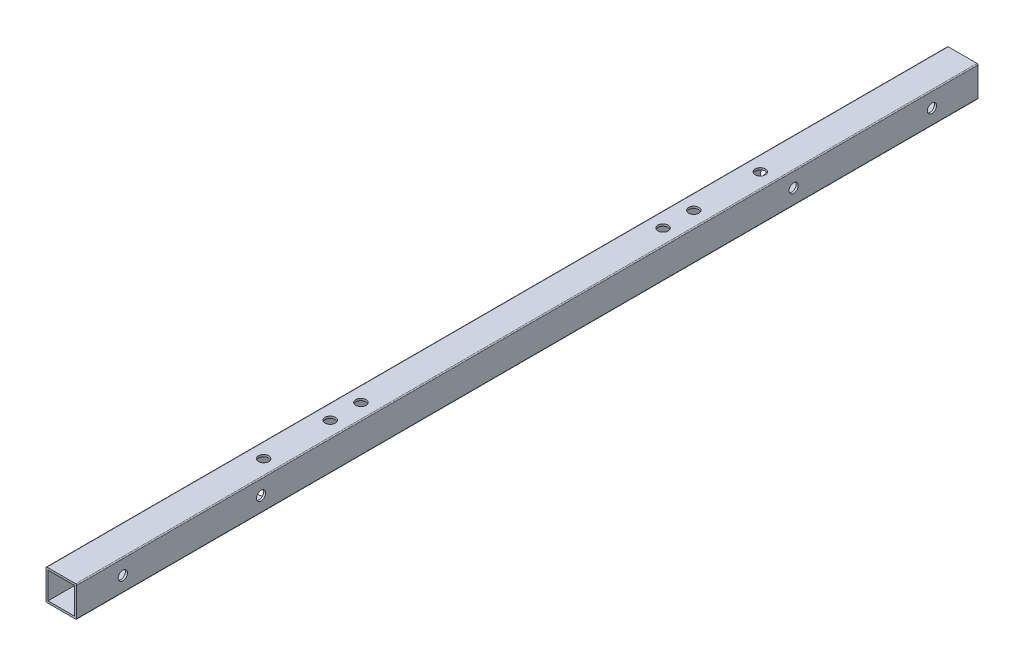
ISO-10303-21;
HEADER;
FILE_DESCRIPTION(('STEP AP214'),'2;1');
FILE_NAME('part.step','',(''),(''),'','','');
FILE_SCHEMA(('AUTOMOTIVE_DESIGN { 1 0 10303 214 1 1 1 1 }'));
ENDSEC;
DATA;
#1=APPLICATION_CONTEXT('core data for automotive mechanical design processes');
#2=APPLICATION_PROTOCOL_DEFINITION('international standard','automotive_design',2000,#1);
#3=PRODUCT_CONTEXT('',#1,'mechanical');
#4=PRODUCT('Part','Part','',(#3));
#5=PRODUCT_RELATED_PRODUCT_CATEGORY('part','',(#4));
#6=PRODUCT_DEFINITION_FORMATION('','',#4);
#7=PRODUCT_DEFINITION_CONTEXT('part definition',#1,'design');
#8=PRODUCT_DEFINITION('design','',#6,#7);
#9=PRODUCT_DEFINITION_SHAPE('','',#8);
#10=(LENGTH_UNIT() NAMED_UNIT(*) SI_UNIT(.MILLI.,.METRE.));
#11=(NAMED_UNIT(*) PLANE_ANGLE_UNIT() SI_UNIT($,.RADIAN.));
#12=(NAMED_UNIT(*) SI_UNIT($,.STERADIAN.) SOLID_ANGLE_UNIT());
#13=UNCERTAINTY_MEASURE_WITH_UNIT(LENGTH_MEASURE(1.E-05),#10,'distance_accuracy_value','');
#14=(GEOMETRIC_REPRESENTATION_CONTEXT(3) GLOBAL_UNCERTAINTY_ASSIGNED_CONTEXT((#13)) GLOBAL_UNIT_ASSIGNED_CONTEXT((#10,
#11,#12)) REPRESENTATION_CONTEXT('',''));
#15=CARTESIAN_POINT('',(0.,0.,0.));
#16=DIRECTION('',(0.,0.,1.));
#17=DIRECTION('',(1.,0.,0.));
#18=AXIS2_PLACEMENT_3D('',#15,#16,#17);
#19=CARTESIAN_POINT('',(-14.,-14.,880.));
#20=DIRECTION('',(0.,0.,-1.));
#21=DIRECTION('',(-1.,0.,0.));
#22=AXIS2_PLACEMENT_3D('',#19,#20,#21);
#23=CYLINDRICAL_SURFACE('',#22,0.999999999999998);
#24=CARTESIAN_POINT('',(-14.,-14.,0.));
#25=DIRECTION('',(0.,0.,-1.));
#26=DIRECTION('',(-1.,0.,0.));
#27=AXIS2_PLACEMENT_3D('',#24,#25,#26);
#28=CIRCLE('',#27,0.999999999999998);
#29=CARTESIAN_POINT('',(-14.,-15.,0.));
#30=VERTEX_POINT('',#29);
#31=CARTESIAN_POINT('',(-15.,-14.,0.));
#32=VERTEX_POINT('',#31);
#33=EDGE_CURVE('E126',#30,#32,#28,.T.);
#34=ORIENTED_EDGE('',*,*,#33,.F.);
#35=DIRECTION('',(0.,0.,-1.));
#36=VECTOR('',#35,1.);
#37=CARTESIAN_POINT('',(-14.,-15.,880.));
#38=LINE('',#37,#36);
#39=CARTESIAN_POINT('',(-14.,-15.,880.));
#40=VERTEX_POINT('',#39);
#41=EDGE_CURVE('E11',#40,#30,#38,.T.);
#42=ORIENTED_EDGE('',*,*,#41,.F.);
#43=CARTESIAN_POINT('',(-14.,-14.,880.));
#44=DIRECTION('',(0.,0.,-1.));
#45=DIRECTION('',(-1.,0.,0.));
#46=AXIS2_PLACEMENT_3D('',#43,#44,#45);
#47=CIRCLE('',#46,0.999999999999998);
#48=CARTESIAN_POINT('',(-15.,-14.,880.));
#49=VERTEX_POINT('',#48);
#50=EDGE_CURVE('E184',#40,#49,#47,.T.);
#51=ORIENTED_EDGE('',*,*,#50,.T.);
#52=DIRECTION('',(0.,0.,-1.));
#53=VECTOR('',#52,1.);
#54=CARTESIAN_POINT('',(-15.,-14.,880.));
#55=LINE('',#54,#53);
#56=EDGE_CURVE('E204',#49,#32,#55,.T.);
#57=ORIENTED_EDGE('',*,*,#56,.T.);
#58=EDGE_LOOP('',(#34,#42,#51,#57));
#59=FACE_BOUND('',#58,.T.);
#60=ADVANCED_FACE('F30',(#59),#23,.T.);
#61=CARTESIAN_POINT('',(14.,-15.,880.));
#62=DIRECTION('',(0.,-1.,0.));
#63=DIRECTION('',(1.,0.,0.));
#64=AXIS2_PLACEMENT_3D('',#61,#62,#63);
#65=PLANE('',#64);
#66=CARTESIAN_POINT('',(0.,-15.,682.5));
#67=DIRECTION('',(0.,-1.,0.));
#68=DIRECTION('',(1.,0.,0.));
#69=AXIS2_PLACEMENT_3D('',#66,#67,#68);
#70=CIRCLE('',#69,5.);
#71=CARTESIAN_POINT('',(5.00000000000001,-15.,682.5));
#72=VERTEX_POINT('',#71);
#73=EDGE_CURVE('E293',#72,#72,#70,.T.);
#74=ORIENTED_EDGE('',*,*,#73,.F.);
#75=EDGE_LOOP('',(#74));
#76=FACE_BOUND('',#75,.T.);
#77=CARTESIAN_POINT('',(0.,-15.,617.5));
#78=DIRECTION('',(0.,-1.,0.));
#79=DIRECTION('',(1.,0.,0.));
#80=AXIS2_PLACEMENT_3D('',#77,#78,#79);
#81=CIRCLE('',#80,5.);
#82=CARTESIAN_POINT('',(5.00000000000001,-15.,617.5));
#83=VERTEX_POINT('',#82);
#84=EDGE_CURVE('E300',#83,#83,#81,.T.);
#85=ORIENTED_EDGE('',*,*,#84,.F.);
#86=EDGE_LOOP('',(#85));
#87=FACE_BOUND('',#86,.T.);
#88=CARTESIAN_POINT('',(0.,-15.,262.5));
#89=DIRECTION('',(0.,-1.,0.));
#90=DIRECTION('',(1.,0.,0.));
#91=AXIS2_PLACEMENT_3D('',#88,#89,#90);
#92=CIRCLE('',#91,5.);
#93=CARTESIAN_POINT('',(5.00000000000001,-15.,262.5));
#94=VERTEX_POINT('',#93);
#95=EDGE_CURVE('E307',#94,#94,#92,.T.);
#96=ORIENTED_EDGE('',*,*,#95,.F.);
#97=EDGE_LOOP('',(#96));
#98=FACE_BOUND('',#97,.T.);
#99=CARTESIAN_POINT('',(0.,-15.,197.5));
#100=DIRECTION('',(0.,-1.,0.));
#101=DIRECTION('',(1.,0.,0.));
#102=AXIS2_PLACEMENT_3D('',#99,#100,#101);
#103=CIRCLE('',#102,5.);
#104=CARTESIAN_POINT('',(5.00000000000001,-15.,197.5));
#105=VERTEX_POINT('',#104);
#106=EDGE_CURVE('E314',#105,#105,#103,.T.);
#107=ORIENTED_EDGE('',*,*,#106,.F.);
#108=EDGE_LOOP('',(#107));
#109=FACE_BOUND('',#108,.T.);
#110=CARTESIAN_POINT('',(0.,-15.,587.5));
#111=DIRECTION('',(0.,-1.,0.));
#112=DIRECTION('',(1.,0.,0.));
#113=AXIS2_PLACEMENT_3D('',#110,#111,#112);
#114=CIRCLE('',#113,5.);
#115=CARTESIAN_POINT('',(5.00000000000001,-15.,587.5));
#116=VERTEX_POINT('',#115);
#117=EDGE_CURVE('E321',#116,#116,#114,.T.);
#118=ORIENTED_EDGE('',*,*,#117,.F.);
#119=EDGE_LOOP('',(#118));
#120=FACE_BOUND('',#119,.T.);
#121=CARTESIAN_POINT('',(0.,-15.,292.5));
#122=DIRECTION('',(0.,-1.,0.));
#123=DIRECTION('',(1.,0.,0.));
#124=AXIS2_PLACEMENT_3D('',#121,#122,#123);
#125=CIRCLE('',#124,5.);
#126=CARTESIAN_POINT('',(5.00000000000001,-15.,292.5));
#127=VERTEX_POINT('',#126);
#128=EDGE_CURVE('E141',#127,#127,#125,.T.);
#129=ORIENTED_EDGE('',*,*,#128,.F.);
#130=EDGE_LOOP('',(#129));
#131=FACE_BOUND('',#130,.T.);
#132=DIRECTION('',(-1.,0.,0.));
#133=VECTOR('',#132,1.);
#134=CARTESIAN_POINT('',(14.,-15.,0.));
#135=LINE('',#134,#133);
#136=CARTESIAN_POINT('',(14.,-15.,0.));
#137=VERTEX_POINT('',#136);
#138=EDGE_CURVE('E181',#137,#30,#135,.T.);
#139=ORIENTED_EDGE('',*,*,#138,.F.);
#140=DIRECTION('',(0.,0.,-1.));
#141=VECTOR('',#140,1.);
#142=CARTESIAN_POINT('',(14.,-15.,880.));
#143=LINE('',#142,#141);
#144=CARTESIAN_POINT('',(14.,-15.,880.));
#145=VERTEX_POINT('',#144);
#146=EDGE_CURVE('E38',#145,#137,#143,.T.);
#147=ORIENTED_EDGE('',*,*,#146,.F.);
#148=DIRECTION('',(-1.,0.,0.));
#149=VECTOR('',#148,1.);
#150=CARTESIAN_POINT('',(14.,-15.,880.));
#151=LINE('',#150,#149);
#152=EDGE_CURVE('E202',#145,#40,#151,.T.);
#153=ORIENTED_EDGE('',*,*,#152,.T.);
#154=ORIENTED_EDGE('',*,*,#41,.T.);
#155=EDGE_LOOP('',(#139,#147,#153,#154));
#156=FACE_BOUND('',#155,.T.);
#157=ADVANCED_FACE('F346',(#76,#87,#98,#109,#120,#131,#156),#65,.T.);
#158=CARTESIAN_POINT('',(14.,-14.,880.));
#159=DIRECTION('',(0.,0.,-1.));
#160=DIRECTION('',(-1.,0.,0.));
#161=AXIS2_PLACEMENT_3D('',#158,#159,#160);
#162=CYLINDRICAL_SURFACE('',#161,1.);
#163=CARTESIAN_POINT('',(14.,-14.,0.));
#164=DIRECTION('',(0.,0.,-1.));
#165=DIRECTION('',(-1.,0.,0.));
#166=AXIS2_PLACEMENT_3D('',#163,#164,#165);
#167=CIRCLE('',#166,1.);
#168=CARTESIAN_POINT('',(15.,-14.,0.));
#169=VERTEX_POINT('',#168);
#170=EDGE_CURVE('E178',#169,#137,#167,.T.);
#171=ORIENTED_EDGE('',*,*,#170,.F.);
#172=DIRECTION('',(0.,0.,-1.));
#173=VECTOR('',#172,1.);
#174=CARTESIAN_POINT('',(15.,-14.,880.));
#175=LINE('',#174,#173);
#176=CARTESIAN_POINT('',(15.,-14.,880.));
#177=VERTEX_POINT('',#176);
#178=EDGE_CURVE('E207',#177,#169,#175,.T.);
#179=ORIENTED_EDGE('',*,*,#178,.F.);
#180=CARTESIAN_POINT('',(14.,-14.,880.));
#181=DIRECTION('',(0.,0.,-1.));
#182=DIRECTION('',(-1.,0.,0.));
#183=AXIS2_PLACEMENT_3D('',#180,#181,#182);
#184=CIRCLE('',#183,1.);
#185=EDGE_CURVE('E199',#177,#145,#184,.T.);
#186=ORIENTED_EDGE('',*,*,#185,.T.);
#187=ORIENTED_EDGE('',*,*,#146,.T.);
#188=EDGE_LOOP('',(#171,#179,#186,#187));
#189=FACE_BOUND('',#188,.T.);
#190=ADVANCED_FACE('F351',(#189),#162,.T.);
#191=CARTESIAN_POINT('',(15.,-14.,880.));
#192=DIRECTION('',(-1.,0.,0.));
#193=DIRECTION('',(0.,-1.,0.));
#194=AXIS2_PLACEMENT_3D('',#191,#192,#193);
#195=PLANE('',#194);
#196=CARTESIAN_POINT('',(15.,0.,45.));
#197=DIRECTION('',(1.,0.,0.));
#198=DIRECTION('',(0.,1.,0.));
#199=AXIS2_PLACEMENT_3D('',#196,#197,#198);
#200=CIRCLE('',#199,4.5);
#201=CARTESIAN_POINT('',(15.,4.5,45.));
#202=VERTEX_POINT('',#201);
#203=EDGE_CURVE('E696',#202,#202,#200,.T.);
#204=ORIENTED_EDGE('',*,*,#203,.F.);
#205=EDGE_LOOP('',(#204));
#206=FACE_BOUND('',#205,.T.);
#207=CARTESIAN_POINT('',(15.,0.,180.));
#208=DIRECTION('',(1.,0.,0.));
#209=DIRECTION('',(0.,1.,0.));
#210=AXIS2_PLACEMENT_3D('',#207,#208,#209);
#211=CIRCLE('',#210,4.49999999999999);
#212=CARTESIAN_POINT('',(15.,4.49999999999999,180.));
#213=VERTEX_POINT('',#212);
#214=EDGE_CURVE('E267',#213,#213,#211,.T.);
#215=ORIENTED_EDGE('',*,*,#214,.F.);
#216=EDGE_LOOP('',(#215));
#217=FACE_BOUND('',#216,.T.);
#218=CARTESIAN_POINT('',(15.,0.,700.));
#219=DIRECTION('',(1.,0.,0.));
#220=DIRECTION('',(0.,1.,0.));
#221=AXIS2_PLACEMENT_3D('',#218,#219,#220);
#222=CIRCLE('',#221,4.49999999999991);
#223=CARTESIAN_POINT('',(15.,4.49999999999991,700.));
#224=VERTEX_POINT('',#223);
#225=EDGE_CURVE('E264',#224,#224,#222,.T.);
#226=ORIENTED_EDGE('',*,*,#225,.F.);
#227=EDGE_LOOP('',(#226));
#228=FACE_BOUND('',#227,.T.);
#229=CARTESIAN_POINT('',(15.,0.,835.));
#230=DIRECTION('',(1.,0.,0.));
#231=DIRECTION('',(0.,1.,0.));
#232=AXIS2_PLACEMENT_3D('',#229,#230,#231);
#233=CIRCLE('',#232,4.49999999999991);
#234=CARTESIAN_POINT('',(15.,4.49999999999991,835.));
#235=VERTEX_POINT('',#234);
#236=EDGE_CURVE('E282',#235,#235,#233,.T.);
#237=ORIENTED_EDGE('',*,*,#236,.F.);
#238=EDGE_LOOP('',(#237));
#239=FACE_BOUND('',#238,.T.);
#240=DIRECTION('',(0.,1.,0.));
#241=VECTOR('',#240,1.);
#242=CARTESIAN_POINT('',(15.,-14.,0.));
#243=LINE('',#242,#241);
#244=CARTESIAN_POINT('',(15.,14.,0.));
#245=VERTEX_POINT('',#244);
#246=EDGE_CURVE('E176',#169,#245,#243,.T.);
#247=ORIENTED_EDGE('',*,*,#246,.T.);
#248=DIRECTION('',(0.,0.,-1.));
#249=VECTOR('',#248,1.);
#250=CARTESIAN_POINT('',(15.,14.,880.));
#251=LINE('',#250,#249);
#252=CARTESIAN_POINT('',(15.,14.,880.));
#253=VERTEX_POINT('',#252);
#254=EDGE_CURVE('E209',#253,#245,#251,.T.);
#255=ORIENTED_EDGE('',*,*,#254,.F.);
#256=DIRECTION('',(0.,1.,0.));
#257=VECTOR('',#256,1.);
#258=CARTESIAN_POINT('',(15.,-14.,880.));
#259=LINE('',#258,#257);
#260=EDGE_CURVE('E197',#177,#253,#259,.T.);
#261=ORIENTED_EDGE('',*,*,#260,.F.);
#262=ORIENTED_EDGE('',*,*,#178,.T.);
#263=EDGE_LOOP('',(#247,#255,#261,#262));
#264=FACE_BOUND('',#263,.T.);
#265=ADVANCED_FACE('F385',(#206,#217,#228,#239,#264),#195,.F.);
#266=CARTESIAN_POINT('',(14.,14.,880.));
#267=DIRECTION('',(0.,0.,-1.));
#268=DIRECTION('',(-1.,0.,0.));
#269=AXIS2_PLACEMENT_3D('',#266,#267,#268);
#270=CYLINDRICAL_SURFACE('',#269,0.999999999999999);
#271=CARTESIAN_POINT('',(14.,14.,0.));
#272=DIRECTION('',(0.,0.,1.));
#273=DIRECTION('',(1.,0.,0.));
#274=AXIS2_PLACEMENT_3D('',#271,#272,#273);
#275=CIRCLE('',#274,0.999999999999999);
#276=CARTESIAN_POINT('',(14.,15.,0.));
#277=VERTEX_POINT('',#276);
#278=EDGE_CURVE('E173',#245,#277,#275,.T.);
#279=ORIENTED_EDGE('',*,*,#278,.T.);
#280=DIRECTION('',(0.,0.,-1.));
#281=VECTOR('',#280,1.);
#282=CARTESIAN_POINT('',(14.,15.,880.));
#283=LINE('',#282,#281);
#284=CARTESIAN_POINT('',(14.,15.,880.));
#285=VERTEX_POINT('',#284);
#286=EDGE_CURVE('E212',#285,#277,#283,.T.);
#287=ORIENTED_EDGE('',*,*,#286,.F.);
#288=CARTESIAN_POINT('',(14.,14.,880.));
#289=DIRECTION('',(0.,0.,1.));
#290=DIRECTION('',(1.,0.,0.));
#291=AXIS2_PLACEMENT_3D('',#288,#289,#290);
#292=CIRCLE('',#291,0.999999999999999);
#293=EDGE_CURVE('E195',#253,#285,#292,.T.);
#294=ORIENTED_EDGE('',*,*,#293,.F.);
#295=ORIENTED_EDGE('',*,*,#254,.T.);
#296=EDGE_LOOP('',(#279,#287,#294,#295));
#297=FACE_BOUND('',#296,.T.);
#298=ADVANCED_FACE('F380',(#297),#270,.T.);
#299=CARTESIAN_POINT('',(-14.,15.,880.));
#300=DIRECTION('',(0.,1.,0.));
#301=DIRECTION('',(0.,0.,1.));
#302=AXIS2_PLACEMENT_3D('',#299,#300,#301);
#303=PLANE('',#302);
#304=CARTESIAN_POINT('',(0.,15.,682.5));
#305=DIRECTION('',(0.,1.,0.));
#306=DIRECTION('',(0.,0.,1.));
#307=AXIS2_PLACEMENT_3D('',#304,#305,#306);
#308=CIRCLE('',#307,5.);
#309=CARTESIAN_POINT('',(0.,15.,687.5));
#310=VERTEX_POINT('',#309);
#311=EDGE_CURVE('E247',#310,#310,#308,.T.);
#312=ORIENTED_EDGE('',*,*,#311,.F.);
#313=EDGE_LOOP('',(#312));
#314=FACE_BOUND('',#313,.T.);
#315=CARTESIAN_POINT('',(0.,15.,617.5));
#316=DIRECTION('',(0.,1.,0.));
#317=DIRECTION('',(0.,0.,1.));
#318=AXIS2_PLACEMENT_3D('',#315,#316,#317);
#319=CIRCLE('',#318,5.);
#320=CARTESIAN_POINT('',(0.,15.,622.5));
#321=VERTEX_POINT('',#320);
#322=EDGE_CURVE('E242',#321,#321,#319,.T.);
#323=ORIENTED_EDGE('',*,*,#322,.F.);
#324=EDGE_LOOP('',(#323));
#325=FACE_BOUND('',#324,.T.);
#326=CARTESIAN_POINT('',(0.,15.,262.5));
#327=DIRECTION('',(0.,1.,0.));
#328=DIRECTION('',(0.,0.,1.));
#329=AXIS2_PLACEMENT_3D('',#326,#327,#328);
#330=CIRCLE('',#329,5.);
#331=CARTESIAN_POINT('',(0.,15.,267.5));
#332=VERTEX_POINT('',#331);
#333=EDGE_CURVE('E237',#332,#332,#330,.T.);
#334=ORIENTED_EDGE('',*,*,#333,.F.);
#335=EDGE_LOOP('',(#334));
#336=FACE_BOUND('',#335,.T.);
#337=CARTESIAN_POINT('',(0.,15.,197.5));
#338=DIRECTION('',(0.,1.,0.));
#339=DIRECTION('',(0.,0.,1.));
#340=AXIS2_PLACEMENT_3D('',#337,#338,#339);
#341=CIRCLE('',#340,5.);
#342=CARTESIAN_POINT('',(0.,15.,202.5));
#343=VERTEX_POINT('',#342);
#344=EDGE_CURVE('E232',#343,#343,#341,.T.);
#345=ORIENTED_EDGE('',*,*,#344,.F.);
#346=EDGE_LOOP('',(#345));
#347=FACE_BOUND('',#346,.T.);
#348=CARTESIAN_POINT('',(0.,15.,587.5));
#349=DIRECTION('',(0.,1.,0.));
#350=DIRECTION('',(0.,0.,1.));
#351=AXIS2_PLACEMENT_3D('',#348,#349,#350);
#352=CIRCLE('',#351,5.);
#353=CARTESIAN_POINT('',(0.,15.,592.5));
#354=VERTEX_POINT('',#353);
#355=EDGE_CURVE('E227',#354,#354,#352,.T.);
#356=ORIENTED_EDGE('',*,*,#355,.F.);
#357=EDGE_LOOP('',(#356));
#358=FACE_BOUND('',#357,.T.);
#359=CARTESIAN_POINT('',(0.,15.,292.5));
#360=DIRECTION('',(0.,1.,0.));
#361=DIRECTION('',(0.,0.,1.));
#362=AXIS2_PLACEMENT_3D('',#359,#360,#361);
#363=CIRCLE('',#362,5.);
#364=CARTESIAN_POINT('',(0.,15.,297.5));
#365=VERTEX_POINT('',#364);
#366=EDGE_CURVE('E222',#365,#365,#363,.T.);
#367=ORIENTED_EDGE('',*,*,#366,.F.);
#368=EDGE_LOOP('',(#367));
#369=FACE_BOUND('',#368,.T.);
#370=DIRECTION('',(1.,0.,0.));
#371=VECTOR('',#370,1.);
#372=CARTESIAN_POINT('',(-14.,15.,0.));
#373=LINE('',#372,#371);
#374=CARTESIAN_POINT('',(-14.,15.,0.));
#375=VERTEX_POINT('',#374);
#376=EDGE_CURVE('E170',#375,#277,#373,.T.);
#377=ORIENTED_EDGE('',*,*,#376,.F.);
#378=DIRECTION('',(0.,0.,-1.));
#379=VECTOR('',#378,1.);
#380=CARTESIAN_POINT('',(-14.,15.,880.));
#381=LINE('',#380,#379);
#382=CARTESIAN_POINT('',(-14.,15.,880.));
#383=VERTEX_POINT('',#382);
#384=EDGE_CURVE('E214',#383,#375,#381,.T.);
#385=ORIENTED_EDGE('',*,*,#384,.F.);
#386=DIRECTION('',(1.,0.,0.));
#387=VECTOR('',#386,1.);
#388=CARTESIAN_POINT('',(-14.,15.,880.));
#389=LINE('',#388,#387);
#390=EDGE_CURVE('E192',#383,#285,#389,.T.);
#391=ORIENTED_EDGE('',*,*,#390,.T.);
#392=ORIENTED_EDGE('',*,*,#286,.T.);
#393=EDGE_LOOP('',(#377,#385,#391,#392));
#394=FACE_BOUND('',#393,.T.);
#395=ADVANCED_FACE('F376',(#314,#325,#336,#347,#358,#369,#394),#303,.T.);
#396=CARTESIAN_POINT('',(-14.,14.,880.));
#397=DIRECTION('',(0.,0.,-1.));
#398=DIRECTION('',(-1.,0.,0.));
#399=AXIS2_PLACEMENT_3D('',#396,#397,#398);
#400=CYLINDRICAL_SURFACE('',#399,0.999999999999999);
#401=CARTESIAN_POINT('',(-14.,14.,0.));
#402=DIRECTION('',(0.,0.,-1.));
#403=DIRECTION('',(-1.,0.,0.));
#404=AXIS2_PLACEMENT_3D('',#401,#402,#403);
#405=CIRCLE('',#404,0.999999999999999);
#406=CARTESIAN_POINT('',(-15.,14.,0.));
#407=VERTEX_POINT('',#406);
#408=EDGE_CURVE('E167',#407,#375,#405,.T.);
#409=ORIENTED_EDGE('',*,*,#408,.F.);
#410=DIRECTION('',(0.,0.,-1.));
#411=VECTOR('',#410,1.);
#412=CARTESIAN_POINT('',(-15.,14.,880.));
#413=LINE('',#412,#411);
#414=CARTESIAN_POINT('',(-15.,14.,880.));
#415=VERTEX_POINT('',#414);
#416=EDGE_CURVE('E216',#415,#407,#413,.T.);
#417=ORIENTED_EDGE('',*,*,#416,.F.);
#418=CARTESIAN_POINT('',(-14.,14.,880.));
#419=DIRECTION('',(0.,0.,-1.));
#420=DIRECTION('',(-1.,0.,0.));
#421=AXIS2_PLACEMENT_3D('',#418,#419,#420);
#422=CIRCLE('',#421,0.999999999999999);
#423=EDGE_CURVE('E189',#415,#383,#422,.T.);
#424=ORIENTED_EDGE('',*,*,#423,.T.);
#425=ORIENTED_EDGE('',*,*,#384,.T.);
#426=EDGE_LOOP('',(#409,#417,#424,#425));
#427=FACE_BOUND('',#426,.T.);
#428=ADVANCED_FACE('F373',(#427),#400,.T.);
#429=CARTESIAN_POINT('',(-15.,14.,880.));
#430=DIRECTION('',(1.,0.,0.));
#431=DIRECTION('',(0.,1.,0.));
#432=AXIS2_PLACEMENT_3D('',#429,#430,#431);
#433=PLANE('',#432);
#434=CARTESIAN_POINT('',(-15.,0.,45.));
#435=DIRECTION('',(1.,0.,0.));
#436=DIRECTION('',(0.,1.,0.));
#437=AXIS2_PLACEMENT_3D('',#434,#435,#436);
#438=CIRCLE('',#437,4.5);
#439=CARTESIAN_POINT('',(-15.,4.5,45.));
#440=VERTEX_POINT('',#439);
#441=EDGE_CURVE('E410',#440,#440,#438,.T.);
#442=ORIENTED_EDGE('',*,*,#441,.T.);
#443=EDGE_LOOP('',(#442));
#444=FACE_BOUND('',#443,.T.);
#445=CARTESIAN_POINT('',(-15.,0.,180.));
#446=DIRECTION('',(1.,0.,0.));
#447=DIRECTION('',(0.,1.,0.));
#448=AXIS2_PLACEMENT_3D('',#445,#446,#447);
#449=CIRCLE('',#448,4.49999999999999);
#450=CARTESIAN_POINT('',(-15.,4.49999999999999,180.));
#451=VERTEX_POINT('',#450);
#452=EDGE_CURVE('E260',#451,#451,#449,.T.);
#453=ORIENTED_EDGE('',*,*,#452,.T.);
#454=EDGE_LOOP('',(#453));
#455=FACE_BOUND('',#454,.T.);
#456=CARTESIAN_POINT('',(-15.,0.,700.));
#457=DIRECTION('',(1.,0.,0.));
#458=DIRECTION('',(0.,1.,0.));
#459=AXIS2_PLACEMENT_3D('',#456,#457,#458);
#460=CIRCLE('',#459,4.49999999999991);
#461=CARTESIAN_POINT('',(-15.,4.49999999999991,700.));
#462=VERTEX_POINT('',#461);
#463=EDGE_CURVE('E256',#462,#462,#460,.T.);
#464=ORIENTED_EDGE('',*,*,#463,.T.);
#465=EDGE_LOOP('',(#464));
#466=FACE_BOUND('',#465,.T.);
#467=CARTESIAN_POINT('',(-15.,0.,835.));
#468=DIRECTION('',(1.,0.,0.));
#469=DIRECTION('',(0.,1.,0.));
#470=AXIS2_PLACEMENT_3D('',#467,#468,#469);
#471=CIRCLE('',#470,4.49999999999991);
#472=CARTESIAN_POINT('',(-15.,4.49999999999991,835.));
#473=VERTEX_POINT('',#472);
#474=EDGE_CURVE('E252',#473,#473,#471,.T.);
#475=ORIENTED_EDGE('',*,*,#474,.T.);
#476=EDGE_LOOP('',(#475));
#477=FACE_BOUND('',#476,.T.);
#478=DIRECTION('',(0.,-1.,0.));
#479=VECTOR('',#478,1.);
#480=CARTESIAN_POINT('',(-15.,14.,0.));
#481=LINE('',#480,#479);
#482=EDGE_CURVE('E164',#407,#32,#481,.T.);
#483=ORIENTED_EDGE('',*,*,#482,.T.);
#484=ORIENTED_EDGE('',*,*,#56,.F.);
#485=DIRECTION('',(0.,-1.,0.));
#486=VECTOR('',#485,1.);
#487=CARTESIAN_POINT('',(-15.,14.,880.));
#488=LINE('',#487,#486);
#489=EDGE_CURVE('E187',#415,#49,#488,.T.);
#490=ORIENTED_EDGE('',*,*,#489,.F.);
#491=ORIENTED_EDGE('',*,*,#416,.T.);
#492=EDGE_LOOP('',(#483,#484,#490,#491));
#493=FACE_BOUND('',#492,.T.);
#494=ADVANCED_FACE('F370',(#444,#455,#466,#477,#493),#433,.F.);
#495=CARTESIAN_POINT('',(-14.,-14.,880.));
#496=DIRECTION('',(0.,0.,-1.));
#497=DIRECTION('',(-1.,0.,0.));
#498=AXIS2_PLACEMENT_3D('',#495,#496,#497);
#499=PLANE('',#498);
#500=DIRECTION('',(0.,1.,0.));
#501=VECTOR('',#500,1.);
#502=CARTESIAN_POINT('',(13.,-14.,880.));
#503=LINE('',#502,#501);
#504=CARTESIAN_POINT('',(13.,-13.,880.));
#505=VERTEX_POINT('',#504);
#506=CARTESIAN_POINT('',(13.,13.,880.));
#507=VERTEX_POINT('',#506);
#508=EDGE_CURVE('E153',#505,#507,#503,.T.);
#509=ORIENTED_EDGE('',*,*,#508,.F.);
#510=DIRECTION('',(-1.,0.,0.));
#511=VECTOR('',#510,1.);
#512=CARTESIAN_POINT('',(-14.,-13.,880.));
#513=LINE('',#512,#511);
#514=CARTESIAN_POINT('',(-13.,-13.,880.));
#515=VERTEX_POINT('',#514);
#516=EDGE_CURVE('E151',#505,#515,#513,.T.);
#517=ORIENTED_EDGE('',*,*,#516,.T.);
#518=DIRECTION('',(0.,-1.,0.));
#519=VECTOR('',#518,1.);
#520=CARTESIAN_POINT('',(-13.,-14.,880.));
#521=LINE('',#520,#519);
#522=CARTESIAN_POINT('',(-13.,13.,880.));
#523=VERTEX_POINT('',#522);
#524=EDGE_CURVE('E122',#523,#515,#521,.T.);
#525=ORIENTED_EDGE('',*,*,#524,.F.);
#526=DIRECTION('',(1.,0.,0.));
#527=VECTOR('',#526,1.);
#528=CARTESIAN_POINT('',(-14.,13.,880.));
#529=LINE('',#528,#527);
#530=EDGE_CURVE('E155',#523,#507,#529,.T.);
#531=ORIENTED_EDGE('',*,*,#530,.T.);
#532=EDGE_LOOP('',(#509,#517,#525,#531));
#533=FACE_BOUND('',#532,.T.);
#534=ORIENTED_EDGE('',*,*,#50,.F.);
#535=ORIENTED_EDGE('',*,*,#152,.F.);
#536=ORIENTED_EDGE('',*,*,#185,.F.);
#537=ORIENTED_EDGE('',*,*,#260,.T.);
#538=ORIENTED_EDGE('',*,*,#293,.T.);
#539=ORIENTED_EDGE('',*,*,#390,.F.);
#540=ORIENTED_EDGE('',*,*,#423,.F.);
#541=ORIENTED_EDGE('',*,*,#489,.T.);
#542=EDGE_LOOP('',(#534,#535,#536,#537,#538,#539,#540,#541));
#543=FACE_BOUND('',#542,.T.);
#544=ADVANCED_FACE('F365',(#533,#543),#499,.F.);
#545=CARTESIAN_POINT('',(-14.,-14.,0.));
#546=DIRECTION('',(0.,0.,-1.));
#547=DIRECTION('',(-1.,0.,0.));
#548=AXIS2_PLACEMENT_3D('',#545,#546,#547);
#549=PLANE('',#548);
#550=DIRECTION('',(-1.,0.,0.));
#551=VECTOR('',#550,1.);
#552=CARTESIAN_POINT('',(-14.,-13.,0.));
#553=LINE('',#552,#551);
#554=CARTESIAN_POINT('',(13.,-13.,0.));
#555=VERTEX_POINT('',#554);
#556=CARTESIAN_POINT('',(-13.,-13.,0.));
#557=VERTEX_POINT('',#556);
#558=EDGE_CURVE('E130',#555,#557,#553,.T.);
#559=ORIENTED_EDGE('',*,*,#558,.F.);
#560=DIRECTION('',(0.,1.,0.));
#561=VECTOR('',#560,1.);
#562=CARTESIAN_POINT('',(13.,-14.,0.));
#563=LINE('',#562,#561);
#564=CARTESIAN_POINT('',(13.,13.,0.));
#565=VERTEX_POINT('',#564);
#566=EDGE_CURVE('E135',#555,#565,#563,.T.);
#567=ORIENTED_EDGE('',*,*,#566,.T.);
#568=DIRECTION('',(1.,0.,0.));
#569=VECTOR('',#568,1.);
#570=CARTESIAN_POINT('',(-14.,13.,0.));
#571=LINE('',#570,#569);
#572=CARTESIAN_POINT('',(-13.,13.,0.));
#573=VERTEX_POINT('',#572);
#574=EDGE_CURVE('E140',#573,#565,#571,.T.);
#575=ORIENTED_EDGE('',*,*,#574,.F.);
#576=DIRECTION('',(0.,-1.,0.));
#577=VECTOR('',#576,1.);
#578=CARTESIAN_POINT('',(-13.,-14.,0.));
#579=LINE('',#578,#577);
#580=EDGE_CURVE('E54',#573,#557,#579,.T.);
#581=ORIENTED_EDGE('',*,*,#580,.T.);
#582=EDGE_LOOP('',(#559,#567,#575,#581));
#583=FACE_BOUND('',#582,.T.);
#584=ORIENTED_EDGE('',*,*,#33,.T.);
#585=ORIENTED_EDGE('',*,*,#482,.F.);
#586=ORIENTED_EDGE('',*,*,#408,.T.);
#587=ORIENTED_EDGE('',*,*,#376,.T.);
#588=ORIENTED_EDGE('',*,*,#278,.F.);
#589=ORIENTED_EDGE('',*,*,#246,.F.);
#590=ORIENTED_EDGE('',*,*,#170,.T.);
#591=ORIENTED_EDGE('',*,*,#138,.T.);
#592=EDGE_LOOP('',(#584,#585,#586,#587,#588,#589,#590,#591));
#593=FACE_BOUND('',#592,.T.);
#594=ADVANCED_FACE('F138',(#583,#593),#549,.T.);
#595=CARTESIAN_POINT('',(-13.,-14.,880.));
#596=DIRECTION('',(1.,0.,0.));
#597=DIRECTION('',(0.,1.,0.));
#598=AXIS2_PLACEMENT_3D('',#595,#596,#597);
#599=PLANE('',#598);
#600=CARTESIAN_POINT('',(-13.,0.,45.));
#601=DIRECTION('',(1.,0.,0.));
#602=DIRECTION('',(0.,1.,0.));
#603=AXIS2_PLACEMENT_3D('',#600,#601,#602);
#604=CIRCLE('',#603,4.5);
#605=CARTESIAN_POINT('',(-13.,4.5,45.));
#606=VERTEX_POINT('',#605);
#607=EDGE_CURVE('E272',#606,#606,#604,.T.);
#608=ORIENTED_EDGE('',*,*,#607,.F.);
#609=EDGE_LOOP('',(#608));
#610=FACE_BOUND('',#609,.T.);
#611=CARTESIAN_POINT('',(-13.,0.,180.));
#612=DIRECTION('',(1.,0.,0.));
#613=DIRECTION('',(0.,1.,0.));
#614=AXIS2_PLACEMENT_3D('',#611,#612,#613);
#615=CIRCLE('',#614,4.49999999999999);
#616=CARTESIAN_POINT('',(-13.,4.49999999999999,180.));
#617=VERTEX_POINT('',#616);
#618=EDGE_CURVE('E259',#617,#617,#615,.T.);
#619=ORIENTED_EDGE('',*,*,#618,.F.);
#620=EDGE_LOOP('',(#619));
#621=FACE_BOUND('',#620,.T.);
#622=CARTESIAN_POINT('',(-13.,0.,700.));
#623=DIRECTION('',(1.,0.,0.));
#624=DIRECTION('',(0.,1.,0.));
#625=AXIS2_PLACEMENT_3D('',#622,#623,#624);
#626=CIRCLE('',#625,4.49999999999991);
#627=CARTESIAN_POINT('',(-13.,4.49999999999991,700.));
#628=VERTEX_POINT('',#627);
#629=EDGE_CURVE('E255',#628,#628,#626,.T.);
#630=ORIENTED_EDGE('',*,*,#629,.F.);
#631=EDGE_LOOP('',(#630));
#632=FACE_BOUND('',#631,.T.);
#633=CARTESIAN_POINT('',(-13.,0.,835.));
#634=DIRECTION('',(1.,0.,0.));
#635=DIRECTION('',(0.,1.,0.));
#636=AXIS2_PLACEMENT_3D('',#633,#634,#635);
#637=CIRCLE('',#636,4.49999999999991);
#638=CARTESIAN_POINT('',(-13.,4.49999999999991,835.));
#639=VERTEX_POINT('',#638);
#640=EDGE_CURVE('E251',#639,#639,#637,.T.);
#641=ORIENTED_EDGE('',*,*,#640,.F.);
#642=EDGE_LOOP('',(#641));
#643=FACE_BOUND('',#642,.T.);
#644=ORIENTED_EDGE('',*,*,#580,.F.);
#645=DIRECTION('',(0.,0.,-1.));
#646=VECTOR('',#645,1.);
#647=CARTESIAN_POINT('',(-13.,13.,880.));
#648=LINE('',#647,#646);
#649=EDGE_CURVE('E158',#523,#573,#648,.T.);
#650=ORIENTED_EDGE('',*,*,#649,.F.);
#651=ORIENTED_EDGE('',*,*,#524,.T.);
#652=DIRECTION('',(0.,0.,-1.));
#653=VECTOR('',#652,1.);
#654=CARTESIAN_POINT('',(-13.,-13.,880.));
#655=LINE('',#654,#653);
#656=EDGE_CURVE('E118',#515,#557,#655,.T.);
#657=ORIENTED_EDGE('',*,*,#656,.T.);
#658=EDGE_LOOP('',(#644,#650,#651,#657));
#659=FACE_BOUND('',#658,.T.);
#660=ADVANCED_FACE('F120',(#610,#621,#632,#643,#659),#599,.T.);
#661=CARTESIAN_POINT('',(-14.,-13.,880.));
#662=DIRECTION('',(0.,-1.,0.));
#663=DIRECTION('',(1.,0.,0.));
#664=AXIS2_PLACEMENT_3D('',#661,#662,#663);
#665=PLANE('',#664);
#666=CARTESIAN_POINT('',(0.,-13.,682.5));
#667=DIRECTION('',(0.,-1.,0.));
#668=DIRECTION('',(1.,0.,0.));
#669=AXIS2_PLACEMENT_3D('',#666,#667,#668);
#670=CIRCLE('',#669,5.);
#671=CARTESIAN_POINT('',(5.00000000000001,-13.,682.5));
#672=VERTEX_POINT('',#671);
#673=EDGE_CURVE('E246',#672,#672,#670,.T.);
#674=ORIENTED_EDGE('',*,*,#673,.T.);
#675=EDGE_LOOP('',(#674));
#676=FACE_BOUND('',#675,.T.);
#677=CARTESIAN_POINT('',(0.,-13.,617.5));
#678=DIRECTION('',(0.,-1.,0.));
#679=DIRECTION('',(1.,0.,0.));
#680=AXIS2_PLACEMENT_3D('',#677,#678,#679);
#681=CIRCLE('',#680,5.);
#682=CARTESIAN_POINT('',(5.00000000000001,-13.,617.5));
#683=VERTEX_POINT('',#682);
#684=EDGE_CURVE('E241',#683,#683,#681,.T.);
#685=ORIENTED_EDGE('',*,*,#684,.T.);
#686=EDGE_LOOP('',(#685));
#687=FACE_BOUND('',#686,.T.);
#688=CARTESIAN_POINT('',(0.,-13.,262.5));
#689=DIRECTION('',(0.,-1.,0.));
#690=DIRECTION('',(1.,0.,0.));
#691=AXIS2_PLACEMENT_3D('',#688,#689,#690);
#692=CIRCLE('',#691,5.);
#693=CARTESIAN_POINT('',(5.00000000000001,-13.,262.5));
#694=VERTEX_POINT('',#693);
#695=EDGE_CURVE('E236',#694,#694,#692,.T.);
#696=ORIENTED_EDGE('',*,*,#695,.T.);
#697=EDGE_LOOP('',(#696));
#698=FACE_BOUND('',#697,.T.);
#699=CARTESIAN_POINT('',(0.,-13.,197.5));
#700=DIRECTION('',(0.,-1.,0.));
#701=DIRECTION('',(1.,0.,0.));
#702=AXIS2_PLACEMENT_3D('',#699,#700,#701);
#703=CIRCLE('',#702,5.);
#704=CARTESIAN_POINT('',(5.00000000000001,-13.,197.5));
#705=VERTEX_POINT('',#704);
#706=EDGE_CURVE('E231',#705,#705,#703,.T.);
#707=ORIENTED_EDGE('',*,*,#706,.T.);
#708=EDGE_LOOP('',(#707));
#709=FACE_BOUND('',#708,.T.);
#710=CARTESIAN_POINT('',(0.,-13.,587.5));
#711=DIRECTION('',(0.,-1.,0.));
#712=DIRECTION('',(1.,0.,0.));
#713=AXIS2_PLACEMENT_3D('',#710,#711,#712);
#714=CIRCLE('',#713,5.);
#715=CARTESIAN_POINT('',(5.00000000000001,-13.,587.5));
#716=VERTEX_POINT('',#715);
#717=EDGE_CURVE('E223',#716,#716,#714,.T.);
#718=ORIENTED_EDGE('',*,*,#717,.T.);
#719=EDGE_LOOP('',(#718));
#720=FACE_BOUND('',#719,.T.);
#721=CARTESIAN_POINT('',(0.,-13.,292.5));
#722=DIRECTION('',(0.,-1.,0.));
#723=DIRECTION('',(1.,0.,0.));
#724=AXIS2_PLACEMENT_3D('',#721,#722,#723);
#725=CIRCLE('',#724,5.);
#726=CARTESIAN_POINT('',(5.00000000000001,-13.,292.5));
#727=VERTEX_POINT('',#726);
#728=EDGE_CURVE('E144',#727,#727,#725,.T.);
#729=ORIENTED_EDGE('',*,*,#728,.T.);
#730=EDGE_LOOP('',(#729));
#731=FACE_BOUND('',#730,.T.);
#732=ORIENTED_EDGE('',*,*,#558,.T.);
#733=ORIENTED_EDGE('',*,*,#656,.F.);
#734=ORIENTED_EDGE('',*,*,#516,.F.);
#735=DIRECTION('',(0.,0.,-1.));
#736=VECTOR('',#735,1.);
#737=CARTESIAN_POINT('',(13.,-13.,880.));
#738=LINE('',#737,#736);
#739=EDGE_CURVE('E127',#505,#555,#738,.T.);
#740=ORIENTED_EDGE('',*,*,#739,.T.);
#741=EDGE_LOOP('',(#732,#733,#734,#740));
#742=FACE_BOUND('',#741,.T.);
#743=ADVANCED_FACE('F131',(#676,#687,#698,#709,#720,#731,#742),#665,.F.);
#744=CARTESIAN_POINT('',(13.,-14.,880.));
#745=DIRECTION('',(-1.,0.,0.));
#746=DIRECTION('',(0.,-1.,0.));
#747=AXIS2_PLACEMENT_3D('',#744,#745,#746);
#748=PLANE('',#747);
#749=CARTESIAN_POINT('',(13.,0.,45.));
#750=DIRECTION('',(-1.,0.,0.));
#751=DIRECTION('',(0.,-1.,0.));
#752=AXIS2_PLACEMENT_3D('',#749,#750,#751);
#753=CIRCLE('',#752,4.5);
#754=CARTESIAN_POINT('',(13.,-4.5,45.));
#755=VERTEX_POINT('',#754);
#756=EDGE_CURVE('E33',#755,#755,#753,.T.);
#757=ORIENTED_EDGE('',*,*,#756,.F.);
#758=EDGE_LOOP('',(#757));
#759=FACE_BOUND('',#758,.T.);
#760=CARTESIAN_POINT('',(13.,0.,180.));
#761=DIRECTION('',(-1.,0.,0.));
#762=DIRECTION('',(0.,-1.,0.));
#763=AXIS2_PLACEMENT_3D('',#760,#761,#762);
#764=CIRCLE('',#763,4.49999999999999);
#765=CARTESIAN_POINT('',(13.,-4.49999999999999,180.));
#766=VERTEX_POINT('',#765);
#767=EDGE_CURVE('E257',#766,#766,#764,.T.);
#768=ORIENTED_EDGE('',*,*,#767,.F.);
#769=EDGE_LOOP('',(#768));
#770=FACE_BOUND('',#769,.T.);
#771=CARTESIAN_POINT('',(13.,0.,700.));
#772=DIRECTION('',(-1.,0.,0.));
#773=DIRECTION('',(0.,-1.,0.));
#774=AXIS2_PLACEMENT_3D('',#771,#772,#773);
#775=CIRCLE('',#774,4.49999999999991);
#776=CARTESIAN_POINT('',(13.,-4.49999999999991,700.));
#777=VERTEX_POINT('',#776);
#778=EDGE_CURVE('E253',#777,#777,#775,.T.);
#779=ORIENTED_EDGE('',*,*,#778,.F.);
#780=EDGE_LOOP('',(#779));
#781=FACE_BOUND('',#780,.T.);
#782=CARTESIAN_POINT('',(13.,0.,835.));
#783=DIRECTION('',(-1.,0.,0.));
#784=DIRECTION('',(0.,-1.,0.));
#785=AXIS2_PLACEMENT_3D('',#782,#783,#784);
#786=CIRCLE('',#785,4.49999999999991);
#787=CARTESIAN_POINT('',(13.,-4.49999999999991,835.));
#788=VERTEX_POINT('',#787);
#789=EDGE_CURVE('E248',#788,#788,#786,.T.);
#790=ORIENTED_EDGE('',*,*,#789,.F.);
#791=EDGE_LOOP('',(#790));
#792=FACE_BOUND('',#791,.T.);
#793=ORIENTED_EDGE('',*,*,#566,.F.);
#794=ORIENTED_EDGE('',*,*,#739,.F.);
#795=ORIENTED_EDGE('',*,*,#508,.T.);
#796=DIRECTION('',(0.,0.,-1.));
#797=VECTOR('',#796,1.);
#798=CARTESIAN_POINT('',(13.,13.,880.));
#799=LINE('',#798,#797);
#800=EDGE_CURVE('E46',#507,#565,#799,.T.);
#801=ORIENTED_EDGE('',*,*,#800,.T.);
#802=EDGE_LOOP('',(#793,#794,#795,#801));
#803=FACE_BOUND('',#802,.T.);
#804=ADVANCED_FACE('F463',(#759,#770,#781,#792,#803),#748,.T.);
#805=CARTESIAN_POINT('',(-14.,13.,880.));
#806=DIRECTION('',(0.,1.,0.));
#807=DIRECTION('',(0.,0.,1.));
#808=AXIS2_PLACEMENT_3D('',#805,#806,#807);
#809=PLANE('',#808);
#810=CARTESIAN_POINT('',(0.,13.,682.5));
#811=DIRECTION('',(0.,1.,0.));
#812=DIRECTION('',(0.,0.,1.));
#813=AXIS2_PLACEMENT_3D('',#810,#811,#812);
#814=CIRCLE('',#813,5.);
#815=CARTESIAN_POINT('',(0.,13.,687.5));
#816=VERTEX_POINT('',#815);
#817=EDGE_CURVE('E243',#816,#816,#814,.T.);
#818=ORIENTED_EDGE('',*,*,#817,.T.);
#819=EDGE_LOOP('',(#818));
#820=FACE_BOUND('',#819,.T.);
#821=CARTESIAN_POINT('',(0.,13.,617.5));
#822=DIRECTION('',(0.,1.,0.));
#823=DIRECTION('',(0.,0.,1.));
#824=AXIS2_PLACEMENT_3D('',#821,#822,#823);
#825=CIRCLE('',#824,5.);
#826=CARTESIAN_POINT('',(0.,13.,622.5));
#827=VERTEX_POINT('',#826);
#828=EDGE_CURVE('E238',#827,#827,#825,.T.);
#829=ORIENTED_EDGE('',*,*,#828,.T.);
#830=EDGE_LOOP('',(#829));
#831=FACE_BOUND('',#830,.T.);
#832=CARTESIAN_POINT('',(0.,13.,262.5));
#833=DIRECTION('',(0.,1.,0.));
#834=DIRECTION('',(0.,0.,1.));
#835=AXIS2_PLACEMENT_3D('',#832,#833,#834);
#836=CIRCLE('',#835,5.);
#837=CARTESIAN_POINT('',(0.,13.,267.5));
#838=VERTEX_POINT('',#837);
#839=EDGE_CURVE('E233',#838,#838,#836,.T.);
#840=ORIENTED_EDGE('',*,*,#839,.T.);
#841=EDGE_LOOP('',(#840));
#842=FACE_BOUND('',#841,.T.);
#843=CARTESIAN_POINT('',(0.,13.,197.5));
#844=DIRECTION('',(0.,1.,0.));
#845=DIRECTION('',(0.,0.,1.));
#846=AXIS2_PLACEMENT_3D('',#843,#844,#845);
#847=CIRCLE('',#846,5.);
#848=CARTESIAN_POINT('',(0.,13.,202.5));
#849=VERTEX_POINT('',#848);
#850=EDGE_CURVE('E228',#849,#849,#847,.T.);
#851=ORIENTED_EDGE('',*,*,#850,.T.);
#852=EDGE_LOOP('',(#851));
#853=FACE_BOUND('',#852,.T.);
#854=CARTESIAN_POINT('',(0.,13.,587.5));
#855=DIRECTION('',(0.,1.,0.));
#856=DIRECTION('',(0.,0.,1.));
#857=AXIS2_PLACEMENT_3D('',#854,#855,#856);
#858=CIRCLE('',#857,5.);
#859=CARTESIAN_POINT('',(0.,13.,592.5));
#860=VERTEX_POINT('',#859);
#861=EDGE_CURVE('E226',#860,#860,#858,.T.);
#862=ORIENTED_EDGE('',*,*,#861,.T.);
#863=EDGE_LOOP('',(#862));
#864=FACE_BOUND('',#863,.T.);
#865=CARTESIAN_POINT('',(0.,13.,292.5));
#866=DIRECTION('',(0.,1.,0.));
#867=DIRECTION('',(0.,0.,1.));
#868=AXIS2_PLACEMENT_3D('',#865,#866,#867);
#869=CIRCLE('',#868,5.);
#870=CARTESIAN_POINT('',(0.,13.,297.5));
#871=VERTEX_POINT('',#870);
#872=EDGE_CURVE('E219',#871,#871,#869,.T.);
#873=ORIENTED_EDGE('',*,*,#872,.T.);
#874=EDGE_LOOP('',(#873));
#875=FACE_BOUND('',#874,.T.);
#876=ORIENTED_EDGE('',*,*,#574,.T.);
#877=ORIENTED_EDGE('',*,*,#800,.F.);
#878=ORIENTED_EDGE('',*,*,#530,.F.);
#879=ORIENTED_EDGE('',*,*,#649,.T.);
#880=EDGE_LOOP('',(#876,#877,#878,#879));
#881=FACE_BOUND('',#880,.T.);
#882=ADVANCED_FACE('F342',(#820,#831,#842,#853,#864,#875,#881),#809,.F.);
#883=CARTESIAN_POINT('',(0.,-20.,292.5));
#884=DIRECTION('',(0.,1.,0.));
#885=DIRECTION('',(0.,0.,1.));
#886=AXIS2_PLACEMENT_3D('',#883,#884,#885);
#887=CYLINDRICAL_SURFACE('',#886,5.);
#888=ORIENTED_EDGE('',*,*,#366,.T.);
#889=EDGE_LOOP('',(#888));
#890=FACE_BOUND('',#889,.T.);
#891=ORIENTED_EDGE('',*,*,#872,.F.);
#892=EDGE_LOOP('',(#891));
#893=FACE_BOUND('',#892,.T.);
#894=ADVANCED_FACE('F332',(#890,#893),#887,.F.);
#895=ORIENTED_EDGE('',*,*,#128,.T.);
#896=EDGE_LOOP('',(#895));
#897=FACE_BOUND('',#896,.T.);
#898=ORIENTED_EDGE('',*,*,#728,.F.);
#899=EDGE_LOOP('',(#898));
#900=FACE_BOUND('',#899,.T.);
#901=ADVANCED_FACE('F329',(#897,#900),#887,.F.);
#902=CARTESIAN_POINT('',(0.,-20.,587.5));
#903=DIRECTION('',(0.,1.,0.));
#904=DIRECTION('',(0.,0.,1.));
#905=AXIS2_PLACEMENT_3D('',#902,#903,#904);
#906=CYLINDRICAL_SURFACE('',#905,5.);
#907=ORIENTED_EDGE('',*,*,#117,.T.);
#908=EDGE_LOOP('',(#907));
#909=FACE_BOUND('',#908,.T.);
#910=ORIENTED_EDGE('',*,*,#717,.F.);
#911=EDGE_LOOP('',(#910));
#912=FACE_BOUND('',#911,.T.);
#913=ADVANCED_FACE('F331',(#909,#912),#906,.F.);
#914=ORIENTED_EDGE('',*,*,#355,.T.);
#915=EDGE_LOOP('',(#914));
#916=FACE_BOUND('',#915,.T.);
#917=ORIENTED_EDGE('',*,*,#861,.F.);
#918=EDGE_LOOP('',(#917));
#919=FACE_BOUND('',#918,.T.);
#920=ADVANCED_FACE('F339',(#916,#919),#906,.F.);
#921=CARTESIAN_POINT('',(0.,-20.,197.5));
#922=DIRECTION('',(0.,1.,0.));
#923=DIRECTION('',(0.,0.,1.));
#924=AXIS2_PLACEMENT_3D('',#921,#922,#923);
#925=CYLINDRICAL_SURFACE('',#924,5.);
#926=ORIENTED_EDGE('',*,*,#344,.T.);
#927=EDGE_LOOP('',(#926));
#928=FACE_BOUND('',#927,.T.);
#929=ORIENTED_EDGE('',*,*,#850,.F.);
#930=EDGE_LOOP('',(#929));
#931=FACE_BOUND('',#930,.T.);
#932=ADVANCED_FACE('F449',(#928,#931),#925,.F.);
#933=ORIENTED_EDGE('',*,*,#106,.T.);
#934=EDGE_LOOP('',(#933));
#935=FACE_BOUND('',#934,.T.);
#936=ORIENTED_EDGE('',*,*,#706,.F.);
#937=EDGE_LOOP('',(#936));
#938=FACE_BOUND('',#937,.T.);
#939=ADVANCED_FACE('F447',(#935,#938),#925,.F.);
#940=CARTESIAN_POINT('',(0.,-20.,262.5));
#941=DIRECTION('',(0.,1.,0.));
#942=DIRECTION('',(0.,0.,1.));
#943=AXIS2_PLACEMENT_3D('',#940,#941,#942);
#944=CYLINDRICAL_SURFACE('',#943,5.);
#945=ORIENTED_EDGE('',*,*,#333,.T.);
#946=EDGE_LOOP('',(#945));
#947=FACE_BOUND('',#946,.T.);
#948=ORIENTED_EDGE('',*,*,#839,.F.);
#949=EDGE_LOOP('',(#948));
#950=FACE_BOUND('',#949,.T.);
#951=ADVANCED_FACE('F445',(#947,#950),#944,.F.);
#952=ORIENTED_EDGE('',*,*,#95,.T.);
#953=EDGE_LOOP('',(#952));
#954=FACE_BOUND('',#953,.T.);
#955=ORIENTED_EDGE('',*,*,#695,.F.);
#956=EDGE_LOOP('',(#955));
#957=FACE_BOUND('',#956,.T.);
#958=ADVANCED_FACE('F442',(#954,#957),#944,.F.);
#959=CARTESIAN_POINT('',(0.,-20.,617.5));
#960=DIRECTION('',(0.,1.,0.));
#961=DIRECTION('',(0.,0.,1.));
#962=AXIS2_PLACEMENT_3D('',#959,#960,#961);
#963=CYLINDRICAL_SURFACE('',#962,5.);
#964=ORIENTED_EDGE('',*,*,#322,.T.);
#965=EDGE_LOOP('',(#964));
#966=FACE_BOUND('',#965,.T.);
#967=ORIENTED_EDGE('',*,*,#828,.F.);
#968=EDGE_LOOP('',(#967));
#969=FACE_BOUND('',#968,.T.);
#970=ADVANCED_FACE('F440',(#966,#969),#963,.F.);
#971=ORIENTED_EDGE('',*,*,#84,.T.);
#972=EDGE_LOOP('',(#971));
#973=FACE_BOUND('',#972,.T.);
#974=ORIENTED_EDGE('',*,*,#684,.F.);
#975=EDGE_LOOP('',(#974));
#976=FACE_BOUND('',#975,.T.);
#977=ADVANCED_FACE('F437',(#973,#976),#963,.F.);
#978=CARTESIAN_POINT('',(0.,-20.,682.5));
#979=DIRECTION('',(0.,1.,0.));
#980=DIRECTION('',(0.,0.,1.));
#981=AXIS2_PLACEMENT_3D('',#978,#979,#980);
#982=CYLINDRICAL_SURFACE('',#981,5.);
#983=ORIENTED_EDGE('',*,*,#311,.T.);
#984=EDGE_LOOP('',(#983));
#985=FACE_BOUND('',#984,.T.);
#986=ORIENTED_EDGE('',*,*,#817,.F.);
#987=EDGE_LOOP('',(#986));
#988=FACE_BOUND('',#987,.T.);
#989=ADVANCED_FACE('F435',(#985,#988),#982,.F.);
#990=ORIENTED_EDGE('',*,*,#73,.T.);
#991=EDGE_LOOP('',(#990));
#992=FACE_BOUND('',#991,.T.);
#993=ORIENTED_EDGE('',*,*,#673,.F.);
#994=EDGE_LOOP('',(#993));
#995=FACE_BOUND('',#994,.T.);
#996=ADVANCED_FACE('F429',(#992,#995),#982,.F.);
#997=CARTESIAN_POINT('',(-15.,0.,835.));
#998=DIRECTION('',(1.,0.,0.));
#999=DIRECTION('',(0.,1.,0.));
#1000=AXIS2_PLACEMENT_3D('',#997,#998,#999);
#1001=CYLINDRICAL_SURFACE('',#1000,4.49999999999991);
#1002=ORIENTED_EDGE('',*,*,#789,.T.);
#1003=EDGE_LOOP('',(#1002));
#1004=FACE_BOUND('',#1003,.T.);
#1005=ORIENTED_EDGE('',*,*,#236,.T.);
#1006=EDGE_LOOP('',(#1005));
#1007=FACE_BOUND('',#1006,.T.);
#1008=ADVANCED_FACE('F419',(#1004,#1007),#1001,.F.);
#1009=ORIENTED_EDGE('',*,*,#640,.T.);
#1010=EDGE_LOOP('',(#1009));
#1011=FACE_BOUND('',#1010,.T.);
#1012=ORIENTED_EDGE('',*,*,#474,.F.);
#1013=EDGE_LOOP('',(#1012));
#1014=FACE_BOUND('',#1013,.T.);
#1015=ADVANCED_FACE('F416',(#1011,#1014),#1001,.F.);
#1016=CARTESIAN_POINT('',(-15.,0.,700.));
#1017=DIRECTION('',(1.,0.,0.));
#1018=DIRECTION('',(0.,1.,0.));
#1019=AXIS2_PLACEMENT_3D('',#1016,#1017,#1018);
#1020=CYLINDRICAL_SURFACE('',#1019,4.49999999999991);
#1021=ORIENTED_EDGE('',*,*,#778,.T.);
#1022=EDGE_LOOP('',(#1021));
#1023=FACE_BOUND('',#1022,.T.);
#1024=ORIENTED_EDGE('',*,*,#225,.T.);
#1025=EDGE_LOOP('',(#1024));
#1026=FACE_BOUND('',#1025,.T.);
#1027=ADVANCED_FACE('F418',(#1023,#1026),#1020,.F.);
#1028=ORIENTED_EDGE('',*,*,#629,.T.);
#1029=EDGE_LOOP('',(#1028));
#1030=FACE_BOUND('',#1029,.T.);
#1031=ORIENTED_EDGE('',*,*,#463,.F.);
#1032=EDGE_LOOP('',(#1031));
#1033=FACE_BOUND('',#1032,.T.);
#1034=ADVANCED_FACE('F426',(#1030,#1033),#1020,.F.);
#1035=CARTESIAN_POINT('',(-15.,0.,180.));
#1036=DIRECTION('',(1.,0.,0.));
#1037=DIRECTION('',(0.,1.,0.));
#1038=AXIS2_PLACEMENT_3D('',#1035,#1036,#1037);
#1039=CYLINDRICAL_SURFACE('',#1038,4.49999999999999);
#1040=ORIENTED_EDGE('',*,*,#767,.T.);
#1041=EDGE_LOOP('',(#1040));
#1042=FACE_BOUND('',#1041,.T.);
#1043=ORIENTED_EDGE('',*,*,#214,.T.);
#1044=EDGE_LOOP('',(#1043));
#1045=FACE_BOUND('',#1044,.T.);
#1046=ADVANCED_FACE('F654',(#1042,#1045),#1039,.F.);
#1047=ORIENTED_EDGE('',*,*,#618,.T.);
#1048=EDGE_LOOP('',(#1047));
#1049=FACE_BOUND('',#1048,.T.);
#1050=ORIENTED_EDGE('',*,*,#452,.F.);
#1051=EDGE_LOOP('',(#1050));
#1052=FACE_BOUND('',#1051,.T.);
#1053=ADVANCED_FACE('F663',(#1049,#1052),#1039,.F.);
#1054=CARTESIAN_POINT('',(-15.,0.,45.));
#1055=DIRECTION('',(1.,0.,0.));
#1056=DIRECTION('',(0.,1.,0.));
#1057=AXIS2_PLACEMENT_3D('',#1054,#1055,#1056);
#1058=CYLINDRICAL_SURFACE('',#1057,4.5);
#1059=ORIENTED_EDGE('',*,*,#756,.T.);
#1060=EDGE_LOOP('',(#1059));
#1061=FACE_BOUND('',#1060,.T.);
#1062=ORIENTED_EDGE('',*,*,#203,.T.);
#1063=EDGE_LOOP('',(#1062));
#1064=FACE_BOUND('',#1063,.T.);
#1065=ADVANCED_FACE('F671',(#1061,#1064),#1058,.F.);
#1066=ORIENTED_EDGE('',*,*,#607,.T.);
#1067=EDGE_LOOP('',(#1066));
#1068=FACE_BOUND('',#1067,.T.);
#1069=ORIENTED_EDGE('',*,*,#441,.F.);
#1070=EDGE_LOOP('',(#1069));
#1071=FACE_BOUND('',#1070,.T.);
#1072=ADVANCED_FACE('F680',(#1068,#1071),#1058,.F.);
#1073=CLOSED_SHELL('',(#60,#157,#190,#265,#298,#395,#428,#494,#544,#594,#660,#743,#804,#882,
#894,#901,#913,#920,#932,#939,#951,#958,#970,#977,#989,#996,#1008,#1015,#1027,#1034,#1046,#1053,
#1065,#1072));
#1074=MANIFOLD_SOLID_BREP('B2',#1073);
#1075=ADVANCED_BREP_SHAPE_REPRESENTATION('',(#18,#1074),#14);
#1076=SHAPE_DEFINITION_REPRESENTATION(#9,#1075);
ENDSEC;
END-ISO-10303-21;
